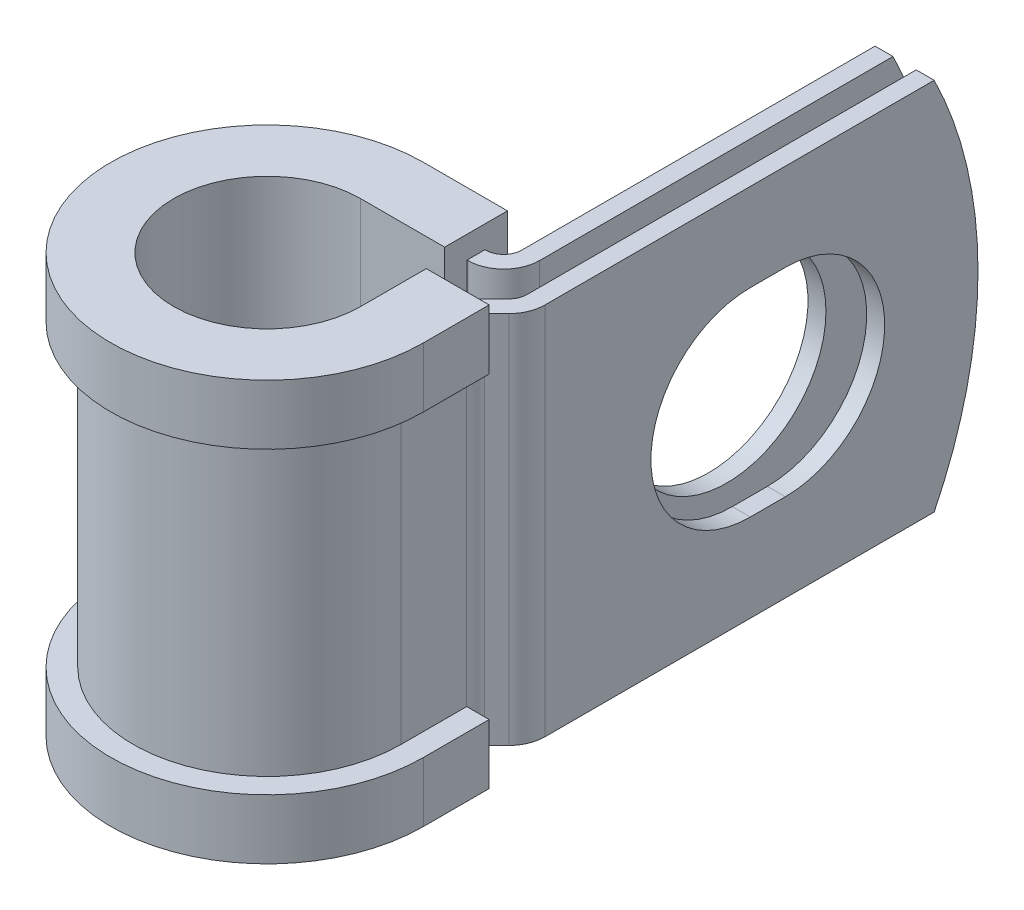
from build123d import *

# Parameters (mm, degrees)
EXTRUDE_THIN1_DEPTH = 12.7
SKETCH2_R           = 6.7437
CUT_EXTRUDE1_DEPTH  = 1.2192
CUT_EXTRUDE2_DEPTH  = 1.2192
CUT_EXTRUDE3_DEPTH  = 43.542822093


with BuildPart() as part:
    # Sketch1 → Extrude-Thin1 (new, symmetric)
    with BuildSketch(Plane(origin=(0, 0, 0), x_dir=(1, 0, 0), z_dir=(0, 1, 0))):
        with BuildLine():
            Line((9.7714698, 37.2872), (9.7714698, 7.874))
            ThreePointArc((9.7714698, 7.874), (9.678663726, 7.407432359), (9.414374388, 7.011895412))
            Line((9.414374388, 7.011895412), (8.588190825, 6.185711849))
            ThreePointArc((8.588190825, 6.185711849), (8.059612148, 5.394637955), (7.874, 4.461502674))
            Line((7.874, 4.461502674), (7.874, 0))
            ThreePointArc((7.874, 0), (-5.567758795, -5.567758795), (0, 7.874))
            Line((0, 7.874), (5.7582698, 7.874))
            ThreePointArc((5.7582698, 7.874), (7.482478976, 8.588190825), (8.1966698, 10.3124))
            Line((8.1966698, 10.3124), (8.1966698, 37.2872))
            Line((8.1966698, 37.2872), (6.9774698, 37.2872))
            Line((6.9774698, 37.2872), (6.9774698, 10.3124))
            ThreePointArc((6.9774698, 10.3124), (6.620374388, 9.450295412), (5.7582698, 9.0932))
            Line((5.7582698, 9.0932), (0, 9.0932))
            ThreePointArc((0, 9.0932), (-6.429863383, -6.429863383), (9.0932, 0))
            Line((9.0932, 0), (9.0932, 4.461502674))
            ThreePointArc((9.0932, 4.461502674), (9.186006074, 4.928070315), (9.450295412, 5.323607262))
            Line((9.450295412, 5.323607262), (10.276478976, 6.149790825))
            ThreePointArc((10.276478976, 6.149790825), (10.805057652, 6.940864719), (10.9906698, 7.874))
            Line((10.9906698, 7.874), (10.9906698, 37.2872))
            Line((10.9906698, 37.2872), (9.7714698, 37.2872))
        make_face()
    extrude(amount=EXTRUDE_THIN1_DEPTH, both=True)

    # Sketch2 → Cut-Extrude1 (cut)
    with BuildSketch(Plane.ZY.offset(-6.9774698)):
        with Locations((-23.0124, 0)):
            Circle(SKETCH2_R)
    extrude(amount=-CUT_EXTRUDE1_DEPTH, mode=Mode.SUBTRACT)

    # Sketch3 → Cut-Extrude2 (cut)
    with BuildSketch(Plane(origin=(10.9906698, 0, 0), x_dir=(0, 0, -1), z_dir=(1, 0, 0))):
        with BuildLine():
            Line((21.8186, 6.7437), (24.2062, 6.7437))
            ThreePointArc((24.2062, 6.7437), (30.9499, 0), (24.2062, -6.7437))
            Line((24.2062, -6.7437), (21.8186, -6.7437))
            ThreePointArc((21.8186, -6.7437), (15.0749, 0), (21.8186, 6.7437))
        make_face()
    extrude(amount=-CUT_EXTRUDE2_DEPTH, mode=Mode.SUBTRACT)

    # Sketch4 → Cut-Extrude3 (cut, through all)
    with BuildSketch(Plane.ZY.offset(-6.9774698)):
        with BuildLine():
            Line((-34.309868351, 12.7), (-37.2872, 12.7))
            Line((-37.2872, 12.7), (-37.2872, 0))
            ThreePointArc((-37.2872, 0), (-36.532911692, 6.522164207), (-34.309868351, 12.7))
        make_face()
        with BuildLine():
            ThreePointArc((-34.309868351, -12.7), (-36.532911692, -6.522164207), (-37.2872, 0))
            Line((-37.2872, 0), (-37.2872, -12.7))
            Line((-37.2872, -12.7), (-34.309868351, -12.7))
        make_face()
    extrude(amount=-CUT_EXTRUDE3_DEPTH, mode=Mode.SUBTRACT)

    # Sweep1: sweep along a path in Sketch6
    with BuildLine(Plane(origin=(0, 12.7, 0), x_dir=(1, 0, 0), z_dir=(0, 1, 0))) as sweep1_path:
        Line((6.35, 4.461502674), (6.35, 0))
        ThreePointArc((6.35, 0), (-4.490128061, -4.490128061), (0, 6.35))
        Line((0, 6.35), (5.7074698, 6.35))
    # Sketch5 → Sweep1 (sweep)
    with BuildSketch(Plane(origin=(0, 0, -4.461502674), x_dir=(-1, 0, 0), z_dir=(0, 0, -1))):
        Polygon((-9.0932, 12.7), (-7.874, 12.7), (-7.874, -12.7), (-9.0932, -12.7), (-9.0932, -10.16), (-10.6172, -10.16), (-10.6172, -14.224), (-6.35, -14.224), (-6.35, 14.224), (-10.6172, 14.224), (-10.6172, 10.16), (-9.0932, 10.16), align=None)
    sweep(path=sweep1_path.line)


solid = part.part
